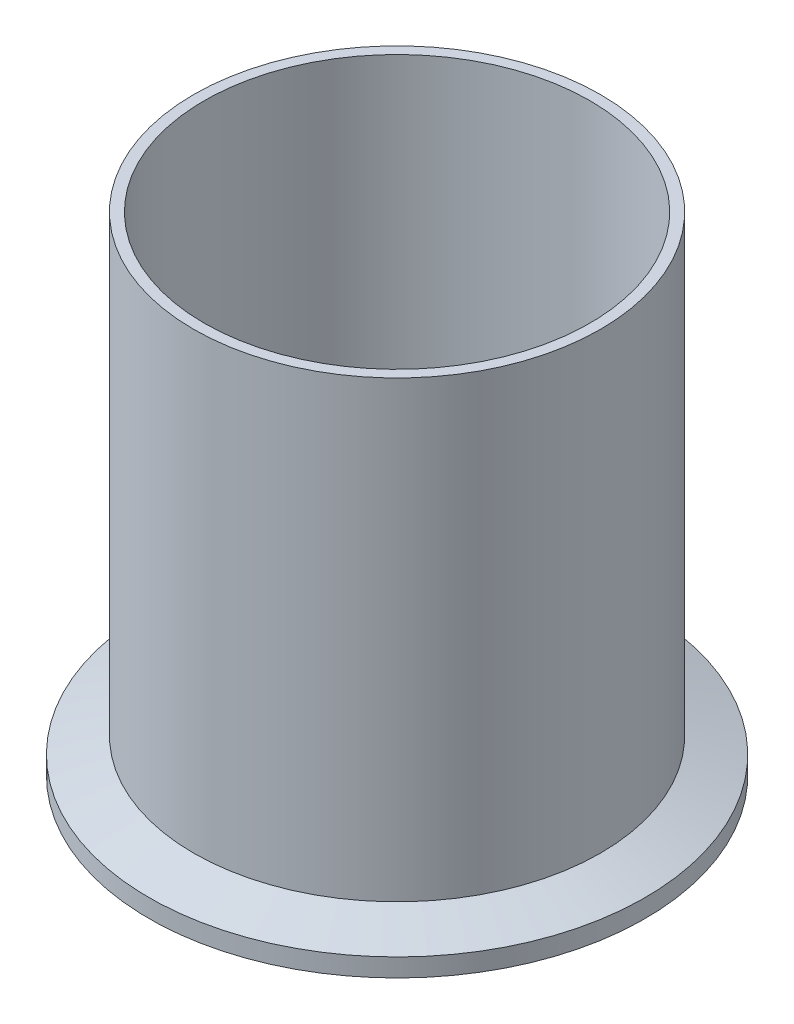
from build123d import *


with BuildPart() as part:
    # Sketch1 → Revolve2 (revolve)
    with BuildSketch(Plane.XY, mode=Mode.PRIVATE) as revolve2_sk:
        with BuildLine():
            Line((-30.099, 0), (-30.099, 76.2))
            Line((-30.099, 76.2), (-31.75, 76.2))
            Line((-31.75, 76.2), (-31.75, 5.377887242))
            Line((-31.75, 5.377887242), (-38.7096, 2.8448))
            Line((-38.7096, 2.8448), (-38.7096, 0))
            Line((-38.7096, 0), (-37.136708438, 0))
            ThreePointArc((-37.136708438, 0), (-36.704511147, 0.129217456), (-36.414166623, 0.474458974))
            ThreePointArc((-36.414166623, 0.474458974), (-35.3187, 1.1938), (-34.223233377, 0.474458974))
            ThreePointArc((-34.223233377, 0.474458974), (-33.932888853, 0.129217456), (-33.500691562, 0))
            Line((-33.500691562, 0), (-30.099, 0))
        make_face()
    revolve(revolve2_sk.sketch.rotate(Axis((0, 0, 0), (0, 1, 0)), 270), axis=Axis((0, 0, 0), (0, 1, 0)))


solid = part.part
